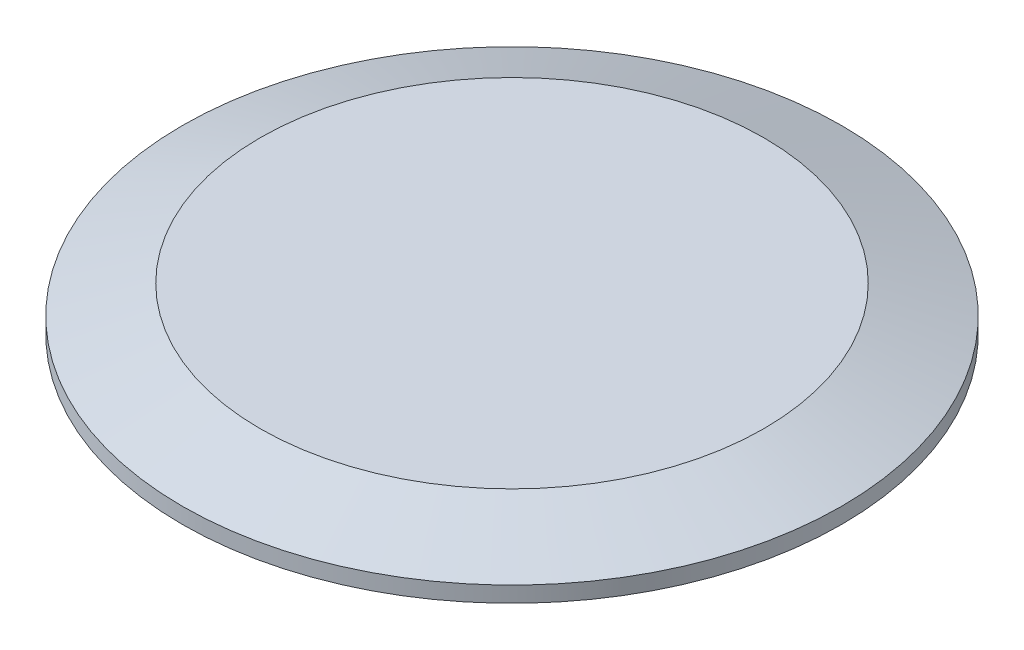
ISO-10303-21;
HEADER;
FILE_DESCRIPTION(('STEP AP214'),'2;1');
FILE_NAME('part.step','',(''),(''),'','','');
FILE_SCHEMA(('AUTOMOTIVE_DESIGN { 1 0 10303 214 1 1 1 1 }'));
ENDSEC;
DATA;
#1=APPLICATION_CONTEXT('core data for automotive mechanical design processes');
#2=APPLICATION_PROTOCOL_DEFINITION('international standard','automotive_design',2000,#1);
#3=PRODUCT_CONTEXT('',#1,'mechanical');
#4=PRODUCT('Part','Part','',(#3));
#5=PRODUCT_RELATED_PRODUCT_CATEGORY('part','',(#4));
#6=PRODUCT_DEFINITION_FORMATION('','',#4);
#7=PRODUCT_DEFINITION_CONTEXT('part definition',#1,'design');
#8=PRODUCT_DEFINITION('design','',#6,#7);
#9=PRODUCT_DEFINITION_SHAPE('','',#8);
#10=(LENGTH_UNIT() NAMED_UNIT(*) SI_UNIT(.MILLI.,.METRE.));
#11=(NAMED_UNIT(*) PLANE_ANGLE_UNIT() SI_UNIT($,.RADIAN.));
#12=(NAMED_UNIT(*) SI_UNIT($,.STERADIAN.) SOLID_ANGLE_UNIT());
#13=UNCERTAINTY_MEASURE_WITH_UNIT(LENGTH_MEASURE(1.E-05),#10,'distance_accuracy_value','');
#14=(GEOMETRIC_REPRESENTATION_CONTEXT(3) GLOBAL_UNCERTAINTY_ASSIGNED_CONTEXT((#13)) GLOBAL_UNIT_ASSIGNED_CONTEXT((#10,
#11,#12)) REPRESENTATION_CONTEXT('',''));
#15=CARTESIAN_POINT('',(0.,0.,0.));
#16=DIRECTION('',(0.,0.,1.));
#17=DIRECTION('',(1.,0.,0.));
#18=AXIS2_PLACEMENT_3D('',#15,#16,#17);
#19=CARTESIAN_POINT('',(-45.4344287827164,7.9502,0.));
#20=DIRECTION('',(0.,1.,0.));
#21=DIRECTION('',(-1.,0.,0.));
#22=AXIS2_PLACEMENT_3D('',#19,#20,#21);
#23=PLANE('',#22);
#24=CARTESIAN_POINT('',(0.,7.95020000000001,0.));
#25=DIRECTION('',(0.,1.,0.));
#26=DIRECTION('',(-1.,0.,0.));
#27=AXIS2_PLACEMENT_3D('',#24,#25,#26);
#28=CIRCLE('',#27,45.4344287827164);
#29=CARTESIAN_POINT('',(-45.4344287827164,7.9502,0.));
#30=VERTEX_POINT('',#29);
#31=EDGE_CURVE('E10',#30,#30,#28,.T.);
#32=ORIENTED_EDGE('',*,*,#31,.T.);
#33=EDGE_LOOP('',(#32));
#34=FACE_BOUND('',#33,.T.);
#35=ADVANCED_FACE('F31',(#34),#23,.T.);
#36=CARTESIAN_POINT('',(0.,7.95020000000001,0.));
#37=DIRECTION('',(0.,-1.,0.));
#38=DIRECTION('',(1.,0.,0.));
#39=AXIS2_PLACEMENT_3D('',#36,#37,#38);
#40=CONICAL_SURFACE('',#39,45.4344287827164,1.22173047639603);
#41=CARTESIAN_POINT('',(0.,2.8448,0.));
#42=DIRECTION('',(0.,1.,0.));
#43=DIRECTION('',(-1.,0.,0.));
#44=AXIS2_PLACEMENT_3D('',#41,#42,#43);
#45=CIRCLE('',#44,59.4614);
#46=CARTESIAN_POINT('',(-59.4614,2.84479999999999,0.));
#47=VERTEX_POINT('',#46);
#48=EDGE_CURVE('E37',#47,#47,#45,.T.);
#49=ORIENTED_EDGE('',*,*,#48,.T.);
#50=EDGE_LOOP('',(#49));
#51=FACE_BOUND('',#50,.T.);
#52=ORIENTED_EDGE('',*,*,#31,.F.);
#53=EDGE_LOOP('',(#52));
#54=FACE_BOUND('',#53,.T.);
#55=ADVANCED_FACE('F72',(#51,#54),#40,.T.);
#56=CARTESIAN_POINT('',(0.,7.9502,0.));
#57=DIRECTION('',(0.,1.,0.));
#58=DIRECTION('',(-1.,0.,0.));
#59=AXIS2_PLACEMENT_3D('',#56,#57,#58);
#60=CYLINDRICAL_SURFACE('',#59,59.4614);
#61=CARTESIAN_POINT('',(0.,0.,0.));
#62=DIRECTION('',(0.,1.,0.));
#63=DIRECTION('',(-1.,0.,0.));
#64=AXIS2_PLACEMENT_3D('',#61,#62,#63);
#65=CIRCLE('',#64,59.4614);
#66=CARTESIAN_POINT('',(-59.4614,0.,0.));
#67=VERTEX_POINT('',#66);
#68=EDGE_CURVE('E41',#67,#67,#65,.T.);
#69=ORIENTED_EDGE('',*,*,#68,.T.);
#70=EDGE_LOOP('',(#69));
#71=FACE_BOUND('',#70,.T.);
#72=ORIENTED_EDGE('',*,*,#48,.F.);
#73=EDGE_LOOP('',(#72));
#74=FACE_BOUND('',#73,.T.);
#75=ADVANCED_FACE('F76',(#71,#74),#60,.T.);
#76=CARTESIAN_POINT('',(-56.6185084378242,0.,0.));
#77=DIRECTION('',(0.,-1.,0.));
#78=DIRECTION('',(1.,0.,0.));
#79=AXIS2_PLACEMENT_3D('',#76,#77,#78);
#80=PLANE('',#79);
#81=CARTESIAN_POINT('',(0.,0.,0.));
#82=DIRECTION('',(0.,1.,0.));
#83=DIRECTION('',(-1.,0.,0.));
#84=AXIS2_PLACEMENT_3D('',#81,#82,#83);
#85=CIRCLE('',#84,56.6185084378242);
#86=CARTESIAN_POINT('',(-56.6185084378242,0.,0.));
#87=VERTEX_POINT('',#86);
#88=EDGE_CURVE('E45',#87,#87,#85,.T.);
#89=ORIENTED_EDGE('',*,*,#88,.T.);
#90=EDGE_LOOP('',(#89));
#91=FACE_BOUND('',#90,.T.);
#92=ORIENTED_EDGE('',*,*,#68,.F.);
#93=EDGE_LOOP('',(#92));
#94=FACE_BOUND('',#93,.T.);
#95=ADVANCED_FACE('F80',(#91,#94),#80,.T.);
#96=CARTESIAN_POINT('',(0.,0.787400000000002,0.));
#97=DIRECTION('',(0.,1.,0.));
#98=DIRECTION('',(-1.,0.,0.));
#99=AXIS2_PLACEMENT_3D('',#96,#97,#98);
#100=TOROIDAL_SURFACE('',#99,56.6185084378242,0.787400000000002);
#101=CARTESIAN_POINT('',(0.,0.474458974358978,0.));
#102=DIRECTION('',(0.,1.,0.));
#103=DIRECTION('',(-1.,0.,0.));
#104=AXIS2_PLACEMENT_3D('',#101,#102,#103);
#105=CIRCLE('',#104,55.8959666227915);
#106=CARTESIAN_POINT('',(-55.8959666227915,0.474458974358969,0.));
#107=VERTEX_POINT('',#106);
#108=EDGE_CURVE('E50',#107,#107,#105,.T.);
#109=ORIENTED_EDGE('',*,*,#108,.T.);
#110=EDGE_LOOP('',(#109));
#111=FACE_BOUND('',#110,.T.);
#112=ORIENTED_EDGE('',*,*,#88,.F.);
#113=EDGE_LOOP('',(#112));
#114=FACE_BOUND('',#113,.T.);
#115=ADVANCED_FACE('F87',(#111,#114),#100,.T.);
#116=CARTESIAN_POINT('',(0.,0.,0.));
#117=DIRECTION('',(0.,1.,0.));
#118=DIRECTION('',(-1.,0.,0.));
#119=AXIS2_PLACEMENT_3D('',#116,#117,#118);
#120=TOROIDAL_SURFACE('',#119,54.8005,1.1938);
#121=CARTESIAN_POINT('',(0.,0.474458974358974,0.));
#122=DIRECTION('',(0.,1.,0.));
#123=DIRECTION('',(-1.,0.,0.));
#124=AXIS2_PLACEMENT_3D('',#121,#122,#123);
#125=CIRCLE('',#124,53.7050333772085);
#126=CARTESIAN_POINT('',(-53.7050333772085,0.474458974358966,0.));
#127=VERTEX_POINT('',#126);
#128=EDGE_CURVE('E53',#127,#127,#125,.T.);
#129=ORIENTED_EDGE('',*,*,#128,.T.);
#130=EDGE_LOOP('',(#129));
#131=FACE_BOUND('',#130,.T.);
#132=ORIENTED_EDGE('',*,*,#108,.F.);
#133=EDGE_LOOP('',(#132));
#134=FACE_BOUND('',#133,.T.);
#135=ADVANCED_FACE('F69',(#131,#134),#120,.F.);
#136=CARTESIAN_POINT('',(0.,0.787400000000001,0.));
#137=DIRECTION('',(0.,1.,0.));
#138=DIRECTION('',(-1.,0.,0.));
#139=AXIS2_PLACEMENT_3D('',#136,#137,#138);
#140=TOROIDAL_SURFACE('',#139,52.9824915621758,0.787399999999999);
#141=CARTESIAN_POINT('',(0.,0.,0.));
#142=DIRECTION('',(0.,1.,0.));
#143=DIRECTION('',(-1.,0.,0.));
#144=AXIS2_PLACEMENT_3D('',#141,#142,#143);
#145=CIRCLE('',#144,52.9824915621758);
#146=CARTESIAN_POINT('',(-52.9824915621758,0.,0.));
#147=VERTEX_POINT('',#146);
#148=EDGE_CURVE('E56',#147,#147,#145,.T.);
#149=ORIENTED_EDGE('',*,*,#148,.T.);
#150=EDGE_LOOP('',(#149));
#151=FACE_BOUND('',#150,.T.);
#152=ORIENTED_EDGE('',*,*,#128,.F.);
#153=EDGE_LOOP('',(#152));
#154=FACE_BOUND('',#153,.T.);
#155=ADVANCED_FACE('F60',(#151,#154),#140,.T.);
#156=CARTESIAN_POINT('',(0.,0.,0.));
#157=DIRECTION('',(0.,-1.,0.));
#158=DIRECTION('',(1.,0.,0.));
#159=AXIS2_PLACEMENT_3D('',#156,#157,#158);
#160=PLANE('',#159);
#161=ORIENTED_EDGE('',*,*,#148,.F.);
#162=EDGE_LOOP('',(#161));
#163=FACE_BOUND('',#162,.T.);
#164=ADVANCED_FACE('F63',(#163),#160,.T.);
#165=CLOSED_SHELL('',(#35,#55,#75,#95,#115,#135,#155,#164));
#166=MANIFOLD_SOLID_BREP('B2',#165);
#167=ADVANCED_BREP_SHAPE_REPRESENTATION('',(#18,#166),#14);
#168=SHAPE_DEFINITION_REPRESENTATION(#9,#167);
ENDSEC;
END-ISO-10303-21;
